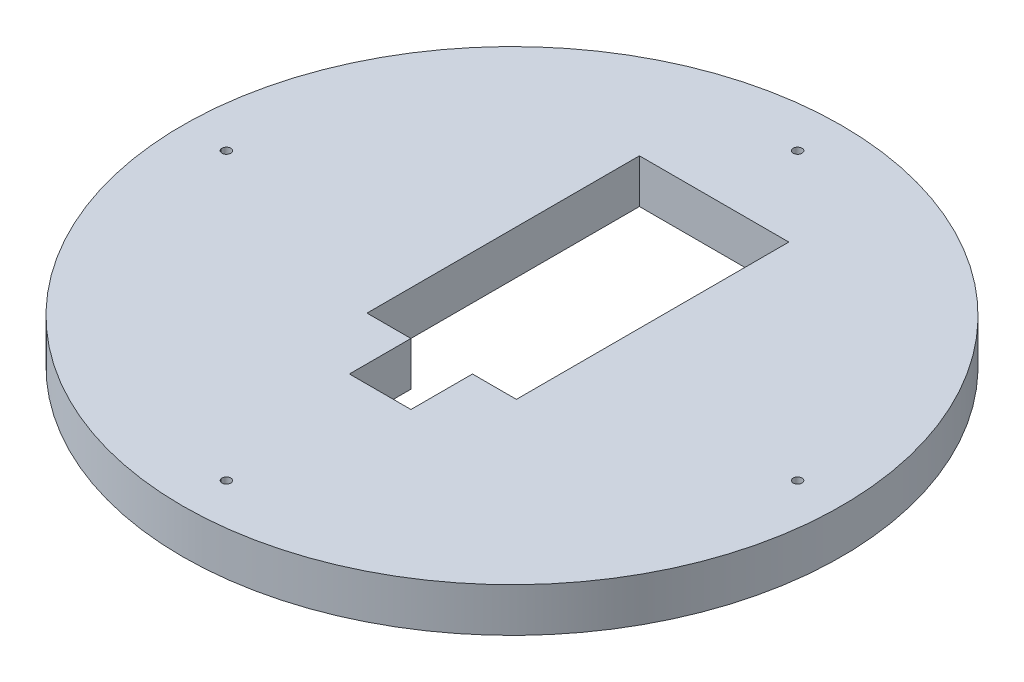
ISO-10303-21;
HEADER;
FILE_DESCRIPTION(('STEP AP214'),'2;1');
FILE_NAME('part.step','',(''),(''),'','','');
FILE_SCHEMA(('AUTOMOTIVE_DESIGN { 1 0 10303 214 1 1 1 1 }'));
ENDSEC;
DATA;
#1=APPLICATION_CONTEXT('core data for automotive mechanical design processes');
#2=APPLICATION_PROTOCOL_DEFINITION('international standard','automotive_design',2000,#1);
#3=PRODUCT_CONTEXT('',#1,'mechanical');
#4=PRODUCT('Part','Part','',(#3));
#5=PRODUCT_RELATED_PRODUCT_CATEGORY('part','',(#4));
#6=PRODUCT_DEFINITION_FORMATION('','',#4);
#7=PRODUCT_DEFINITION_CONTEXT('part definition',#1,'design');
#8=PRODUCT_DEFINITION('design','',#6,#7);
#9=PRODUCT_DEFINITION_SHAPE('','',#8);
#10=(LENGTH_UNIT() NAMED_UNIT(*) SI_UNIT(.MILLI.,.METRE.));
#11=(NAMED_UNIT(*) PLANE_ANGLE_UNIT() SI_UNIT($,.RADIAN.));
#12=(NAMED_UNIT(*) SI_UNIT($,.STERADIAN.) SOLID_ANGLE_UNIT());
#13=UNCERTAINTY_MEASURE_WITH_UNIT(LENGTH_MEASURE(1.E-05),#10,'distance_accuracy_value','');
#14=(GEOMETRIC_REPRESENTATION_CONTEXT(3) GLOBAL_UNCERTAINTY_ASSIGNED_CONTEXT((#13)) GLOBAL_UNIT_ASSIGNED_CONTEXT((#10,
#11,#12)) REPRESENTATION_CONTEXT('',''));
#15=CARTESIAN_POINT('',(0.,0.,0.));
#16=DIRECTION('',(0.,0.,1.));
#17=DIRECTION('',(1.,0.,0.));
#18=AXIS2_PLACEMENT_3D('',#15,#16,#17);
#19=CARTESIAN_POINT('',(0.,5.,0.));
#20=DIRECTION('',(0.,1.,0.));
#21=DIRECTION('',(0.,0.,1.));
#22=AXIS2_PLACEMENT_3D('',#19,#20,#21);
#23=PLANE('',#22);
#24=CARTESIAN_POINT('',(0.,5.,-32.5));
#25=DIRECTION('',(0.,1.,0.));
#26=DIRECTION('',(0.,0.,1.));
#27=AXIS2_PLACEMENT_3D('',#24,#25,#26);
#28=CIRCLE('',#27,0.500000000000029);
#29=CARTESIAN_POINT('',(0.,5.,-32.));
#30=VERTEX_POINT('',#29);
#31=EDGE_CURVE('E311',#30,#30,#28,.T.);
#32=ORIENTED_EDGE('',*,*,#31,.F.);
#33=EDGE_LOOP('',(#32));
#34=FACE_BOUND('',#33,.T.);
#35=CARTESIAN_POINT('',(32.5000000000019,5.,0.));
#36=DIRECTION('',(0.,1.,0.));
#37=DIRECTION('',(0.,0.,1.));
#38=AXIS2_PLACEMENT_3D('',#35,#36,#37);
#39=CIRCLE('',#38,0.499999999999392);
#40=CARTESIAN_POINT('',(32.5000000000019,5.,0.499999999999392));
#41=VERTEX_POINT('',#40);
#42=EDGE_CURVE('E316',#41,#41,#39,.T.);
#43=ORIENTED_EDGE('',*,*,#42,.F.);
#44=EDGE_LOOP('',(#43));
#45=FACE_BOUND('',#44,.T.);
#46=CARTESIAN_POINT('',(0.,5.,32.4999999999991));
#47=DIRECTION('',(0.,1.,0.));
#48=DIRECTION('',(0.,0.,1.));
#49=AXIS2_PLACEMENT_3D('',#46,#47,#48);
#50=CIRCLE('',#49,0.500000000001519);
#51=CARTESIAN_POINT('',(0.,5.,33.0000000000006));
#52=VERTEX_POINT('',#51);
#53=EDGE_CURVE('E324',#52,#52,#50,.T.);
#54=ORIENTED_EDGE('',*,*,#53,.F.);
#55=EDGE_LOOP('',(#54));
#56=FACE_BOUND('',#55,.T.);
#57=CARTESIAN_POINT('',(-32.4999999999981,5.,0.));
#58=DIRECTION('',(0.,1.,0.));
#59=DIRECTION('',(0.,0.,1.));
#60=AXIS2_PLACEMENT_3D('',#57,#58,#59);
#61=CIRCLE('',#60,0.499999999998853);
#62=CARTESIAN_POINT('',(-32.4999999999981,5.,0.499999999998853));
#63=VERTEX_POINT('',#62);
#64=EDGE_CURVE('E329',#63,#63,#61,.T.);
#65=ORIENTED_EDGE('',*,*,#64,.F.);
#66=EDGE_LOOP('',(#65));
#67=FACE_BOUND('',#66,.T.);
#68=CARTESIAN_POINT('',(0.,5.,0.));
#69=DIRECTION('',(0.,1.,0.));
#70=DIRECTION('',(0.,0.,1.));
#71=AXIS2_PLACEMENT_3D('',#68,#69,#70);
#72=CIRCLE('',#71,37.5);
#73=CARTESIAN_POINT('',(0.,5.,37.5));
#74=VERTEX_POINT('',#73);
#75=EDGE_CURVE('E11',#74,#74,#72,.T.);
#76=ORIENTED_EDGE('',*,*,#75,.T.);
#77=EDGE_LOOP('',(#76));
#78=FACE_BOUND('',#77,.T.);
#79=DIRECTION('',(1.,0.,0.));
#80=VECTOR('',#79,1.);
#81=CARTESIAN_POINT('',(0.,5.,8.));
#82=LINE('',#81,#80);
#83=CARTESIAN_POINT('',(3.5,5.,8.));
#84=VERTEX_POINT('',#83);
#85=CARTESIAN_POINT('',(8.5,5.,8.));
#86=VERTEX_POINT('',#85);
#87=EDGE_CURVE('E105',#84,#86,#82,.T.);
#88=ORIENTED_EDGE('',*,*,#87,.F.);
#89=DIRECTION('',(0.,0.,-1.));
#90=VECTOR('',#89,1.);
#91=CARTESIAN_POINT('',(3.5,5.,0.));
#92=LINE('',#91,#90);
#93=CARTESIAN_POINT('',(3.5,5.,15.));
#94=VERTEX_POINT('',#93);
#95=EDGE_CURVE('E97',#94,#84,#92,.T.);
#96=ORIENTED_EDGE('',*,*,#95,.F.);
#97=DIRECTION('',(1.,0.,0.));
#98=VECTOR('',#97,1.);
#99=CARTESIAN_POINT('',(0.,5.,15.));
#100=LINE('',#99,#98);
#101=CARTESIAN_POINT('',(-3.5,5.,15.));
#102=VERTEX_POINT('',#101);
#103=EDGE_CURVE('E130',#102,#94,#100,.T.);
#104=ORIENTED_EDGE('',*,*,#103,.F.);
#105=DIRECTION('',(0.,0.,1.));
#106=VECTOR('',#105,1.);
#107=CARTESIAN_POINT('',(-3.5,5.,0.));
#108=LINE('',#107,#106);
#109=CARTESIAN_POINT('',(-3.5,5.,8.));
#110=VERTEX_POINT('',#109);
#111=EDGE_CURVE('E128',#110,#102,#108,.T.);
#112=ORIENTED_EDGE('',*,*,#111,.F.);
#113=DIRECTION('',(1.,0.,0.));
#114=VECTOR('',#113,1.);
#115=CARTESIAN_POINT('',(0.,5.,8.));
#116=LINE('',#115,#114);
#117=CARTESIAN_POINT('',(-8.5,5.,8.));
#118=VERTEX_POINT('',#117);
#119=EDGE_CURVE('E126',#118,#110,#116,.T.);
#120=ORIENTED_EDGE('',*,*,#119,.F.);
#121=DIRECTION('',(0.,0.,1.));
#122=VECTOR('',#121,1.);
#123=CARTESIAN_POINT('',(-8.5,5.,0.));
#124=LINE('',#123,#122);
#125=CARTESIAN_POINT('',(-8.5,5.,-23.));
#126=VERTEX_POINT('',#125);
#127=EDGE_CURVE('E124',#126,#118,#124,.T.);
#128=ORIENTED_EDGE('',*,*,#127,.F.);
#129=DIRECTION('',(-1.,0.,0.));
#130=VECTOR('',#129,1.);
#131=CARTESIAN_POINT('',(0.,5.,-23.));
#132=LINE('',#131,#130);
#133=CARTESIAN_POINT('',(8.5,5.,-23.));
#134=VERTEX_POINT('',#133);
#135=EDGE_CURVE('E119',#134,#126,#132,.T.);
#136=ORIENTED_EDGE('',*,*,#135,.F.);
#137=DIRECTION('',(0.,0.,-1.));
#138=VECTOR('',#137,1.);
#139=CARTESIAN_POINT('',(8.5,5.,0.));
#140=LINE('',#139,#138);
#141=EDGE_CURVE('E117',#86,#134,#140,.T.);
#142=ORIENTED_EDGE('',*,*,#141,.F.);
#143=EDGE_LOOP('',(#88,#96,#104,#112,#120,#128,#136,#142));
#144=FACE_BOUND('',#143,.T.);
#145=ADVANCED_FACE('F32',(#34,#45,#56,#67,#78,#144),#23,.T.);
#146=CARTESIAN_POINT('',(0.,0.,0.));
#147=DIRECTION('',(0.,1.,0.));
#148=DIRECTION('',(0.,0.,1.));
#149=AXIS2_PLACEMENT_3D('',#146,#147,#148);
#150=PLANE('',#149);
#151=CARTESIAN_POINT('',(0.,0.,-32.5));
#152=DIRECTION('',(0.,1.,0.));
#153=DIRECTION('',(0.,0.,1.));
#154=AXIS2_PLACEMENT_3D('',#151,#152,#153);
#155=CIRCLE('',#154,0.500000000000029);
#156=CARTESIAN_POINT('',(0.,0.,-32.));
#157=VERTEX_POINT('',#156);
#158=EDGE_CURVE('E133',#157,#157,#155,.T.);
#159=ORIENTED_EDGE('',*,*,#158,.T.);
#160=EDGE_LOOP('',(#159));
#161=FACE_BOUND('',#160,.T.);
#162=CARTESIAN_POINT('',(32.5000000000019,0.,0.));
#163=DIRECTION('',(0.,1.,0.));
#164=DIRECTION('',(0.,0.,1.));
#165=AXIS2_PLACEMENT_3D('',#162,#163,#164);
#166=CIRCLE('',#165,0.499999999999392);
#167=CARTESIAN_POINT('',(32.5000000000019,0.,0.499999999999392));
#168=VERTEX_POINT('',#167);
#169=EDGE_CURVE('E312',#168,#168,#166,.T.);
#170=ORIENTED_EDGE('',*,*,#169,.T.);
#171=EDGE_LOOP('',(#170));
#172=FACE_BOUND('',#171,.T.);
#173=CARTESIAN_POINT('',(0.,0.,32.4999999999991));
#174=DIRECTION('',(0.,1.,0.));
#175=DIRECTION('',(0.,0.,1.));
#176=AXIS2_PLACEMENT_3D('',#173,#174,#175);
#177=CIRCLE('',#176,0.500000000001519);
#178=CARTESIAN_POINT('',(0.,0.,33.0000000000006));
#179=VERTEX_POINT('',#178);
#180=EDGE_CURVE('E321',#179,#179,#177,.T.);
#181=ORIENTED_EDGE('',*,*,#180,.T.);
#182=EDGE_LOOP('',(#181));
#183=FACE_BOUND('',#182,.T.);
#184=CARTESIAN_POINT('',(-32.4999999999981,0.,0.));
#185=DIRECTION('',(0.,1.,0.));
#186=DIRECTION('',(0.,0.,1.));
#187=AXIS2_PLACEMENT_3D('',#184,#185,#186);
#188=CIRCLE('',#187,0.499999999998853);
#189=CARTESIAN_POINT('',(-32.4999999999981,0.,0.499999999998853));
#190=VERTEX_POINT('',#189);
#191=EDGE_CURVE('E327',#190,#190,#188,.T.);
#192=ORIENTED_EDGE('',*,*,#191,.T.);
#193=EDGE_LOOP('',(#192));
#194=FACE_BOUND('',#193,.T.);
#195=CARTESIAN_POINT('',(0.,0.,0.));
#196=DIRECTION('',(0.,1.,0.));
#197=DIRECTION('',(0.,0.,1.));
#198=AXIS2_PLACEMENT_3D('',#195,#196,#197);
#199=CIRCLE('',#198,37.5);
#200=CARTESIAN_POINT('',(0.,0.,37.5));
#201=VERTEX_POINT('',#200);
#202=EDGE_CURVE('E36',#201,#201,#199,.T.);
#203=ORIENTED_EDGE('',*,*,#202,.F.);
#204=EDGE_LOOP('',(#203));
#205=FACE_BOUND('',#204,.T.);
#206=DIRECTION('',(0.,0.,-1.));
#207=VECTOR('',#206,1.);
#208=CARTESIAN_POINT('',(3.5,0.,0.));
#209=LINE('',#208,#207);
#210=CARTESIAN_POINT('',(3.5,0.,15.));
#211=VERTEX_POINT('',#210);
#212=CARTESIAN_POINT('',(3.5,0.,8.));
#213=VERTEX_POINT('',#212);
#214=EDGE_CURVE('E55',#211,#213,#209,.T.);
#215=ORIENTED_EDGE('',*,*,#214,.T.);
#216=DIRECTION('',(1.,0.,0.));
#217=VECTOR('',#216,1.);
#218=CARTESIAN_POINT('',(0.,0.,8.));
#219=LINE('',#218,#217);
#220=CARTESIAN_POINT('',(8.5,0.,8.));
#221=VERTEX_POINT('',#220);
#222=EDGE_CURVE('E112',#213,#221,#219,.T.);
#223=ORIENTED_EDGE('',*,*,#222,.T.);
#224=DIRECTION('',(0.,0.,-1.));
#225=VECTOR('',#224,1.);
#226=CARTESIAN_POINT('',(8.5,0.,0.));
#227=LINE('',#226,#225);
#228=CARTESIAN_POINT('',(8.5,0.,-23.));
#229=VERTEX_POINT('',#228);
#230=EDGE_CURVE('E135',#221,#229,#227,.T.);
#231=ORIENTED_EDGE('',*,*,#230,.T.);
#232=DIRECTION('',(-1.,0.,0.));
#233=VECTOR('',#232,1.);
#234=CARTESIAN_POINT('',(0.,0.,-23.));
#235=LINE('',#234,#233);
#236=CARTESIAN_POINT('',(-8.5,0.,-23.));
#237=VERTEX_POINT('',#236);
#238=EDGE_CURVE('E138',#229,#237,#235,.T.);
#239=ORIENTED_EDGE('',*,*,#238,.T.);
#240=DIRECTION('',(0.,0.,1.));
#241=VECTOR('',#240,1.);
#242=CARTESIAN_POINT('',(-8.5,0.,0.));
#243=LINE('',#242,#241);
#244=CARTESIAN_POINT('',(-8.5,0.,8.));
#245=VERTEX_POINT('',#244);
#246=EDGE_CURVE('E141',#237,#245,#243,.T.);
#247=ORIENTED_EDGE('',*,*,#246,.T.);
#248=DIRECTION('',(1.,0.,0.));
#249=VECTOR('',#248,1.);
#250=CARTESIAN_POINT('',(0.,0.,8.));
#251=LINE('',#250,#249);
#252=CARTESIAN_POINT('',(-3.5,0.,8.));
#253=VERTEX_POINT('',#252);
#254=EDGE_CURVE('E144',#245,#253,#251,.T.);
#255=ORIENTED_EDGE('',*,*,#254,.T.);
#256=DIRECTION('',(0.,0.,1.));
#257=VECTOR('',#256,1.);
#258=CARTESIAN_POINT('',(-3.5,0.,0.));
#259=LINE('',#258,#257);
#260=CARTESIAN_POINT('',(-3.5,0.,15.));
#261=VERTEX_POINT('',#260);
#262=EDGE_CURVE('E147',#253,#261,#259,.T.);
#263=ORIENTED_EDGE('',*,*,#262,.T.);
#264=DIRECTION('',(1.,0.,0.));
#265=VECTOR('',#264,1.);
#266=CARTESIAN_POINT('',(0.,0.,15.));
#267=LINE('',#266,#265);
#268=EDGE_CURVE('E106',#261,#211,#267,.T.);
#269=ORIENTED_EDGE('',*,*,#268,.T.);
#270=EDGE_LOOP('',(#215,#223,#231,#239,#247,#255,#263,#269));
#271=FACE_BOUND('',#270,.T.);
#272=ADVANCED_FACE('F168',(#161,#172,#183,#194,#205,#271),#150,.F.);
#273=CARTESIAN_POINT('',(0.,5.,0.));
#274=DIRECTION('',(0.,-1.,0.));
#275=DIRECTION('',(0.,0.,-1.));
#276=AXIS2_PLACEMENT_3D('',#273,#274,#275);
#277=CYLINDRICAL_SURFACE('',#276,37.5);
#278=ORIENTED_EDGE('',*,*,#75,.F.);
#279=EDGE_LOOP('',(#278));
#280=FACE_BOUND('',#279,.T.);
#281=ORIENTED_EDGE('',*,*,#202,.T.);
#282=EDGE_LOOP('',(#281));
#283=FACE_BOUND('',#282,.T.);
#284=ADVANCED_FACE('F34',(#280,#283),#277,.T.);
#285=CARTESIAN_POINT('',(3.5,5.,0.));
#286=DIRECTION('',(-1.,0.,0.));
#287=DIRECTION('',(0.,0.,1.));
#288=AXIS2_PLACEMENT_3D('',#285,#286,#287);
#289=PLANE('',#288);
#290=ORIENTED_EDGE('',*,*,#214,.F.);
#291=DIRECTION('',(0.,-1.,0.));
#292=VECTOR('',#291,1.);
#293=CARTESIAN_POINT('',(3.5,5.,15.));
#294=LINE('',#293,#292);
#295=EDGE_CURVE('E101',#94,#211,#294,.T.);
#296=ORIENTED_EDGE('',*,*,#295,.F.);
#297=ORIENTED_EDGE('',*,*,#95,.T.);
#298=DIRECTION('',(0.,-1.,0.));
#299=VECTOR('',#298,1.);
#300=CARTESIAN_POINT('',(3.5,5.,8.));
#301=LINE('',#300,#299);
#302=EDGE_CURVE('E100',#84,#213,#301,.T.);
#303=ORIENTED_EDGE('',*,*,#302,.T.);
#304=EDGE_LOOP('',(#290,#296,#297,#303));
#305=FACE_BOUND('',#304,.T.);
#306=ADVANCED_FACE('F99',(#305),#289,.T.);
#307=CARTESIAN_POINT('',(0.,5.,8.));
#308=DIRECTION('',(0.,0.,-1.));
#309=DIRECTION('',(-1.,0.,0.));
#310=AXIS2_PLACEMENT_3D('',#307,#308,#309);
#311=PLANE('',#310);
#312=ORIENTED_EDGE('',*,*,#222,.F.);
#313=ORIENTED_EDGE('',*,*,#302,.F.);
#314=ORIENTED_EDGE('',*,*,#87,.T.);
#315=DIRECTION('',(0.,-1.,0.));
#316=VECTOR('',#315,1.);
#317=CARTESIAN_POINT('',(8.5,5.,8.));
#318=LINE('',#317,#316);
#319=EDGE_CURVE('E113',#86,#221,#318,.T.);
#320=ORIENTED_EDGE('',*,*,#319,.T.);
#321=EDGE_LOOP('',(#312,#313,#314,#320));
#322=FACE_BOUND('',#321,.T.);
#323=ADVANCED_FACE('F109',(#322),#311,.T.);
#324=CARTESIAN_POINT('',(8.5,5.,0.));
#325=DIRECTION('',(-1.,0.,0.));
#326=DIRECTION('',(0.,0.,1.));
#327=AXIS2_PLACEMENT_3D('',#324,#325,#326);
#328=PLANE('',#327);
#329=ORIENTED_EDGE('',*,*,#230,.F.);
#330=ORIENTED_EDGE('',*,*,#319,.F.);
#331=ORIENTED_EDGE('',*,*,#141,.T.);
#332=DIRECTION('',(0.,-1.,0.));
#333=VECTOR('',#332,1.);
#334=CARTESIAN_POINT('',(8.5,5.,-23.));
#335=LINE('',#334,#333);
#336=EDGE_CURVE('E160',#134,#229,#335,.T.);
#337=ORIENTED_EDGE('',*,*,#336,.T.);
#338=EDGE_LOOP('',(#329,#330,#331,#337));
#339=FACE_BOUND('',#338,.T.);
#340=ADVANCED_FACE('F164',(#339),#328,.T.);
#341=CARTESIAN_POINT('',(0.,5.,-23.));
#342=DIRECTION('',(0.,0.,1.));
#343=DIRECTION('',(1.,0.,0.));
#344=AXIS2_PLACEMENT_3D('',#341,#342,#343);
#345=PLANE('',#344);
#346=ORIENTED_EDGE('',*,*,#238,.F.);
#347=ORIENTED_EDGE('',*,*,#336,.F.);
#348=ORIENTED_EDGE('',*,*,#135,.T.);
#349=DIRECTION('',(0.,-1.,0.));
#350=VECTOR('',#349,1.);
#351=CARTESIAN_POINT('',(-8.5,5.,-23.));
#352=LINE('',#351,#350);
#353=EDGE_CURVE('E158',#126,#237,#352,.T.);
#354=ORIENTED_EDGE('',*,*,#353,.T.);
#355=EDGE_LOOP('',(#346,#347,#348,#354));
#356=FACE_BOUND('',#355,.T.);
#357=ADVANCED_FACE('F186',(#356),#345,.T.);
#358=CARTESIAN_POINT('',(-8.5,5.,0.));
#359=DIRECTION('',(1.,0.,0.));
#360=DIRECTION('',(0.,0.,-1.));
#361=AXIS2_PLACEMENT_3D('',#358,#359,#360);
#362=PLANE('',#361);
#363=ORIENTED_EDGE('',*,*,#246,.F.);
#364=ORIENTED_EDGE('',*,*,#353,.F.);
#365=ORIENTED_EDGE('',*,*,#127,.T.);
#366=DIRECTION('',(0.,-1.,0.));
#367=VECTOR('',#366,1.);
#368=CARTESIAN_POINT('',(-8.5,5.,8.));
#369=LINE('',#368,#367);
#370=EDGE_CURVE('E156',#118,#245,#369,.T.);
#371=ORIENTED_EDGE('',*,*,#370,.T.);
#372=EDGE_LOOP('',(#363,#364,#365,#371));
#373=FACE_BOUND('',#372,.T.);
#374=ADVANCED_FACE('F183',(#373),#362,.T.);
#375=CARTESIAN_POINT('',(0.,5.,8.));
#376=DIRECTION('',(0.,0.,-1.));
#377=DIRECTION('',(-1.,0.,0.));
#378=AXIS2_PLACEMENT_3D('',#375,#376,#377);
#379=PLANE('',#378);
#380=ORIENTED_EDGE('',*,*,#254,.F.);
#381=ORIENTED_EDGE('',*,*,#370,.F.);
#382=ORIENTED_EDGE('',*,*,#119,.T.);
#383=DIRECTION('',(0.,-1.,0.));
#384=VECTOR('',#383,1.);
#385=CARTESIAN_POINT('',(-3.5,5.,8.));
#386=LINE('',#385,#384);
#387=EDGE_CURVE('E154',#110,#253,#386,.T.);
#388=ORIENTED_EDGE('',*,*,#387,.T.);
#389=EDGE_LOOP('',(#380,#381,#382,#388));
#390=FACE_BOUND('',#389,.T.);
#391=ADVANCED_FACE('F179',(#390),#379,.T.);
#392=CARTESIAN_POINT('',(-3.5,5.,0.));
#393=DIRECTION('',(1.,0.,0.));
#394=DIRECTION('',(0.,0.,-1.));
#395=AXIS2_PLACEMENT_3D('',#392,#393,#394);
#396=PLANE('',#395);
#397=ORIENTED_EDGE('',*,*,#262,.F.);
#398=ORIENTED_EDGE('',*,*,#387,.F.);
#399=ORIENTED_EDGE('',*,*,#111,.T.);
#400=DIRECTION('',(0.,-1.,0.));
#401=VECTOR('',#400,1.);
#402=CARTESIAN_POINT('',(-3.5,5.,15.));
#403=LINE('',#402,#401);
#404=EDGE_CURVE('E47',#102,#261,#403,.T.);
#405=ORIENTED_EDGE('',*,*,#404,.T.);
#406=EDGE_LOOP('',(#397,#398,#399,#405));
#407=FACE_BOUND('',#406,.T.);
#408=ADVANCED_FACE('F176',(#407),#396,.T.);
#409=CARTESIAN_POINT('',(0.,5.,15.));
#410=DIRECTION('',(0.,0.,-1.));
#411=DIRECTION('',(-1.,0.,0.));
#412=AXIS2_PLACEMENT_3D('',#409,#410,#411);
#413=PLANE('',#412);
#414=ORIENTED_EDGE('',*,*,#268,.F.);
#415=ORIENTED_EDGE('',*,*,#404,.F.);
#416=ORIENTED_EDGE('',*,*,#103,.T.);
#417=ORIENTED_EDGE('',*,*,#295,.T.);
#418=EDGE_LOOP('',(#414,#415,#416,#417));
#419=FACE_BOUND('',#418,.T.);
#420=ADVANCED_FACE('F170',(#419),#413,.T.);
#421=CARTESIAN_POINT('',(-32.4999999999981,0.,0.));
#422=DIRECTION('',(0.,1.,0.));
#423=DIRECTION('',(0.,0.,1.));
#424=AXIS2_PLACEMENT_3D('',#421,#422,#423);
#425=CYLINDRICAL_SURFACE('',#424,0.499999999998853);
#426=ORIENTED_EDGE('',*,*,#191,.F.);
#427=EDGE_LOOP('',(#426));
#428=FACE_BOUND('',#427,.T.);
#429=ORIENTED_EDGE('',*,*,#64,.T.);
#430=EDGE_LOOP('',(#429));
#431=FACE_BOUND('',#430,.T.);
#432=ADVANCED_FACE('F251',(#428,#431),#425,.F.);
#433=CARTESIAN_POINT('',(0.,0.,32.4999999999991));
#434=DIRECTION('',(0.,1.,0.));
#435=DIRECTION('',(0.,0.,1.));
#436=AXIS2_PLACEMENT_3D('',#433,#434,#435);
#437=CYLINDRICAL_SURFACE('',#436,0.500000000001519);
#438=ORIENTED_EDGE('',*,*,#180,.F.);
#439=EDGE_LOOP('',(#438));
#440=FACE_BOUND('',#439,.T.);
#441=ORIENTED_EDGE('',*,*,#53,.T.);
#442=EDGE_LOOP('',(#441));
#443=FACE_BOUND('',#442,.T.);
#444=ADVANCED_FACE('F273',(#440,#443),#437,.F.);
#445=CARTESIAN_POINT('',(32.5000000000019,0.,0.));
#446=DIRECTION('',(0.,1.,0.));
#447=DIRECTION('',(0.,0.,1.));
#448=AXIS2_PLACEMENT_3D('',#445,#446,#447);
#449=CYLINDRICAL_SURFACE('',#448,0.499999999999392);
#450=ORIENTED_EDGE('',*,*,#169,.F.);
#451=EDGE_LOOP('',(#450));
#452=FACE_BOUND('',#451,.T.);
#453=ORIENTED_EDGE('',*,*,#42,.T.);
#454=EDGE_LOOP('',(#453));
#455=FACE_BOUND('',#454,.T.);
#456=ADVANCED_FACE('F283',(#452,#455),#449,.F.);
#457=CARTESIAN_POINT('',(0.,0.,-32.5));
#458=DIRECTION('',(0.,1.,0.));
#459=DIRECTION('',(0.,0.,1.));
#460=AXIS2_PLACEMENT_3D('',#457,#458,#459);
#461=CYLINDRICAL_SURFACE('',#460,0.500000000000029);
#462=ORIENTED_EDGE('',*,*,#158,.F.);
#463=EDGE_LOOP('',(#462));
#464=FACE_BOUND('',#463,.T.);
#465=ORIENTED_EDGE('',*,*,#31,.T.);
#466=EDGE_LOOP('',(#465));
#467=FACE_BOUND('',#466,.T.);
#468=ADVANCED_FACE('F293',(#464,#467),#461,.F.);
#469=CLOSED_SHELL('',(#145,#272,#284,#306,#323,#340,#357,#374,#391,#408,#420,#432,#444,#456,#468));
#470=MANIFOLD_SOLID_BREP('B2',#469);
#471=ADVANCED_BREP_SHAPE_REPRESENTATION('',(#18,#470),#14);
#472=SHAPE_DEFINITION_REPRESENTATION(#9,#471);
ENDSEC;
END-ISO-10303-21;
